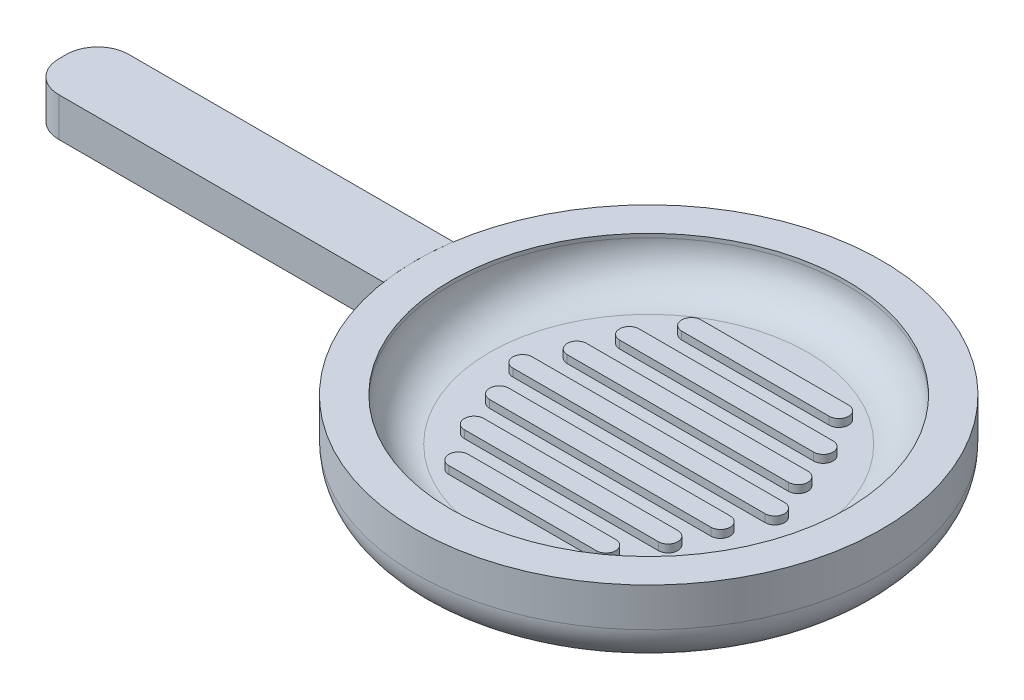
ISO-10303-21;
HEADER;
FILE_DESCRIPTION(('STEP AP214'),'2;1');
FILE_NAME('part.step','',(''),(''),'','','');
FILE_SCHEMA(('AUTOMOTIVE_DESIGN { 1 0 10303 214 1 1 1 1 }'));
ENDSEC;
DATA;
#1=APPLICATION_CONTEXT('core data for automotive mechanical design processes');
#2=APPLICATION_PROTOCOL_DEFINITION('international standard','automotive_design',2000,#1);
#3=PRODUCT_CONTEXT('',#1,'mechanical');
#4=PRODUCT('Part','Part','',(#3));
#5=PRODUCT_RELATED_PRODUCT_CATEGORY('part','',(#4));
#6=PRODUCT_DEFINITION_FORMATION('','',#4);
#7=PRODUCT_DEFINITION_CONTEXT('part definition',#1,'design');
#8=PRODUCT_DEFINITION('design','',#6,#7);
#9=PRODUCT_DEFINITION_SHAPE('','',#8);
#10=(LENGTH_UNIT() NAMED_UNIT(*) SI_UNIT(.MILLI.,.METRE.));
#11=(NAMED_UNIT(*) PLANE_ANGLE_UNIT() SI_UNIT($,.RADIAN.));
#12=(NAMED_UNIT(*) SI_UNIT($,.STERADIAN.) SOLID_ANGLE_UNIT());
#13=UNCERTAINTY_MEASURE_WITH_UNIT(LENGTH_MEASURE(1.E-05),#10,'distance_accuracy_value','');
#14=(GEOMETRIC_REPRESENTATION_CONTEXT(3) GLOBAL_UNCERTAINTY_ASSIGNED_CONTEXT((#13)) GLOBAL_UNIT_ASSIGNED_CONTEXT((#10,
#11,#12)) REPRESENTATION_CONTEXT('',''));
#15=CARTESIAN_POINT('',(0.,0.,0.));
#16=DIRECTION('',(0.,0.,1.));
#17=DIRECTION('',(1.,0.,0.));
#18=AXIS2_PLACEMENT_3D('',#15,#16,#17);
#19=CARTESIAN_POINT('',(-143.,10.,1.));
#20=DIRECTION('',(0.,1.,0.));
#21=DIRECTION('',(0.,0.,1.));
#22=AXIS2_PLACEMENT_3D('',#19,#20,#21);
#23=CYLINDRICAL_SURFACE('',#22,8.);
#24=CARTESIAN_POINT('',(-143.,20.,1.));
#25=DIRECTION('',(0.,1.,0.));
#26=DIRECTION('',(0.,0.,-1.));
#27=AXIS2_PLACEMENT_3D('',#24,#25,#26);
#28=CIRCLE('',#27,8.);
#29=CARTESIAN_POINT('',(-151.,20.,0.999999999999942));
#30=VERTEX_POINT('',#29);
#31=CARTESIAN_POINT('',(-143.,20.,9.));
#32=VERTEX_POINT('',#31);
#33=EDGE_CURVE('E135',#30,#32,#28,.T.);
#34=ORIENTED_EDGE('',*,*,#33,.F.);
#35=DIRECTION('',(0.,1.,0.));
#36=VECTOR('',#35,1.);
#37=CARTESIAN_POINT('',(-151.,10.,0.999999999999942));
#38=LINE('',#37,#36);
#39=CARTESIAN_POINT('',(-151.,10.,0.999999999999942));
#40=VERTEX_POINT('',#39);
#41=EDGE_CURVE('E12',#40,#30,#38,.T.);
#42=ORIENTED_EDGE('',*,*,#41,.F.);
#43=CARTESIAN_POINT('',(-143.,10.,1.));
#44=DIRECTION('',(0.,1.,0.));
#45=DIRECTION('',(0.,0.,-1.));
#46=AXIS2_PLACEMENT_3D('',#43,#44,#45);
#47=CIRCLE('',#46,8.);
#48=CARTESIAN_POINT('',(-143.,10.,9.));
#49=VERTEX_POINT('',#48);
#50=EDGE_CURVE('E149',#40,#49,#47,.T.);
#51=ORIENTED_EDGE('',*,*,#50,.T.);
#52=DIRECTION('',(0.,1.,0.));
#53=VECTOR('',#52,1.);
#54=CARTESIAN_POINT('',(-143.,10.,9.));
#55=LINE('',#54,#53);
#56=EDGE_CURVE('E53',#49,#32,#55,.T.);
#57=ORIENTED_EDGE('',*,*,#56,.T.);
#58=EDGE_LOOP('',(#34,#42,#51,#57));
#59=FACE_BOUND('',#58,.T.);
#60=ADVANCED_FACE('F50',(#59),#23,.T.);
#61=CARTESIAN_POINT('',(-151.,10.,-0.999999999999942));
#62=DIRECTION('',(-1.,0.,0.));
#63=DIRECTION('',(0.,0.,1.));
#64=AXIS2_PLACEMENT_3D('',#61,#62,#63);
#65=PLANE('',#64);
#66=DIRECTION('',(0.,0.,1.));
#67=VECTOR('',#66,1.);
#68=CARTESIAN_POINT('',(-151.,20.,-0.999999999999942));
#69=LINE('',#68,#67);
#70=CARTESIAN_POINT('',(-151.,20.,-0.999999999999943));
#71=VERTEX_POINT('',#70);
#72=EDGE_CURVE('E147',#71,#30,#69,.T.);
#73=ORIENTED_EDGE('',*,*,#72,.F.);
#74=DIRECTION('',(0.,1.,0.));
#75=VECTOR('',#74,1.);
#76=CARTESIAN_POINT('',(-151.,10.,-0.999999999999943));
#77=LINE('',#76,#75);
#78=CARTESIAN_POINT('',(-151.,10.,-0.999999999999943));
#79=VERTEX_POINT('',#78);
#80=EDGE_CURVE('E59',#79,#71,#77,.T.);
#81=ORIENTED_EDGE('',*,*,#80,.F.);
#82=DIRECTION('',(0.,0.,1.));
#83=VECTOR('',#82,1.);
#84=CARTESIAN_POINT('',(-151.,10.,-0.999999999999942));
#85=LINE('',#84,#83);
#86=EDGE_CURVE('E125',#79,#40,#85,.T.);
#87=ORIENTED_EDGE('',*,*,#86,.T.);
#88=ORIENTED_EDGE('',*,*,#41,.T.);
#89=EDGE_LOOP('',(#73,#81,#87,#88));
#90=FACE_BOUND('',#89,.T.);
#91=ADVANCED_FACE('F157',(#90),#65,.T.);
#92=CARTESIAN_POINT('',(-143.,10.,-1.));
#93=DIRECTION('',(0.,1.,0.));
#94=DIRECTION('',(0.,0.,1.));
#95=AXIS2_PLACEMENT_3D('',#92,#93,#94);
#96=CYLINDRICAL_SURFACE('',#95,8.);
#97=CARTESIAN_POINT('',(-143.,20.,-1.));
#98=DIRECTION('',(0.,1.,0.));
#99=DIRECTION('',(0.,0.,-1.));
#100=AXIS2_PLACEMENT_3D('',#97,#98,#99);
#101=CIRCLE('',#100,8.);
#102=CARTESIAN_POINT('',(-143.,20.,-9.));
#103=VERTEX_POINT('',#102);
#104=EDGE_CURVE('E112',#103,#71,#101,.T.);
#105=ORIENTED_EDGE('',*,*,#104,.F.);
#106=DIRECTION('',(0.,1.,0.));
#107=VECTOR('',#106,1.);
#108=CARTESIAN_POINT('',(-143.,10.,-9.));
#109=LINE('',#108,#107);
#110=CARTESIAN_POINT('',(-143.,10.,-9.));
#111=VERTEX_POINT('',#110);
#112=EDGE_CURVE('E107',#111,#103,#109,.T.);
#113=ORIENTED_EDGE('',*,*,#112,.F.);
#114=CARTESIAN_POINT('',(-143.,10.,-1.));
#115=DIRECTION('',(0.,1.,0.));
#116=DIRECTION('',(0.,0.,-1.));
#117=AXIS2_PLACEMENT_3D('',#114,#115,#116);
#118=CIRCLE('',#117,8.);
#119=EDGE_CURVE('E110',#111,#79,#118,.T.);
#120=ORIENTED_EDGE('',*,*,#119,.T.);
#121=ORIENTED_EDGE('',*,*,#80,.T.);
#122=EDGE_LOOP('',(#105,#113,#120,#121));
#123=FACE_BOUND('',#122,.T.);
#124=ADVANCED_FACE('F109',(#123),#96,.T.);
#125=CARTESIAN_POINT('',(-143.,10.,-9.));
#126=DIRECTION('',(0.,0.,-1.));
#127=DIRECTION('',(-1.,0.,0.));
#128=AXIS2_PLACEMENT_3D('',#125,#126,#127);
#129=PLANE('',#128);
#130=DIRECTION('',(-1.,0.,0.));
#131=VECTOR('',#130,1.);
#132=CARTESIAN_POINT('',(-143.,20.,-9.));
#133=LINE('',#132,#131);
#134=CARTESIAN_POINT('',(-59.3211597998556,20.,-9.00000000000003));
#135=VERTEX_POINT('',#134);
#136=EDGE_CURVE('E144',#135,#103,#133,.T.);
#137=ORIENTED_EDGE('',*,*,#136,.F.);
#138=DIRECTION('',(0.,1.,0.));
#139=VECTOR('',#138,1.);
#140=CARTESIAN_POINT('',(-59.3211597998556,10.,-9.00000000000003));
#141=LINE('',#140,#139);
#142=CARTESIAN_POINT('',(-59.3211597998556,10.,-9.00000000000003));
#143=VERTEX_POINT('',#142);
#144=EDGE_CURVE('E117',#143,#135,#141,.T.);
#145=ORIENTED_EDGE('',*,*,#144,.F.);
#146=DIRECTION('',(-1.,0.,0.));
#147=VECTOR('',#146,1.);
#148=CARTESIAN_POINT('',(-143.,10.,-9.));
#149=LINE('',#148,#147);
#150=EDGE_CURVE('E123',#143,#111,#149,.T.);
#151=ORIENTED_EDGE('',*,*,#150,.T.);
#152=ORIENTED_EDGE('',*,*,#112,.T.);
#153=EDGE_LOOP('',(#137,#145,#151,#152));
#154=FACE_BOUND('',#153,.T.);
#155=ADVANCED_FACE('F127',(#154),#129,.T.);
#156=CARTESIAN_POINT('',(0.,10.,0.));
#157=DIRECTION('',(0.,1.,0.));
#158=DIRECTION('',(0.,0.,1.));
#159=AXIS2_PLACEMENT_3D('',#156,#157,#158);
#160=CYLINDRICAL_SURFACE('',#159,60.);
#161=CARTESIAN_POINT('',(0.,20.,0.));
#162=DIRECTION('',(0.,-1.,0.));
#163=DIRECTION('',(0.,0.,1.));
#164=AXIS2_PLACEMENT_3D('',#161,#162,#163);
#165=CIRCLE('',#164,60.);
#166=CARTESIAN_POINT('',(-59.3211597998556,20.,9.));
#167=VERTEX_POINT('',#166);
#168=EDGE_CURVE('E141',#167,#135,#165,.T.);
#169=ORIENTED_EDGE('',*,*,#168,.F.);
#170=DIRECTION('',(0.,1.,0.));
#171=VECTOR('',#170,1.);
#172=CARTESIAN_POINT('',(-59.3211597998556,10.,9.));
#173=LINE('',#172,#171);
#174=CARTESIAN_POINT('',(-59.3211597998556,10.,9.));
#175=VERTEX_POINT('',#174);
#176=EDGE_CURVE('E152',#175,#167,#173,.T.);
#177=ORIENTED_EDGE('',*,*,#176,.F.);
#178=CARTESIAN_POINT('',(0.,10.,0.));
#179=DIRECTION('',(0.,-1.,0.));
#180=DIRECTION('',(0.,0.,1.));
#181=AXIS2_PLACEMENT_3D('',#178,#179,#180);
#182=CIRCLE('',#181,60.);
#183=EDGE_CURVE('E128',#175,#143,#182,.T.);
#184=ORIENTED_EDGE('',*,*,#183,.T.);
#185=ORIENTED_EDGE('',*,*,#144,.T.);
#186=EDGE_LOOP('',(#169,#177,#184,#185));
#187=FACE_BOUND('',#186,.T.);
#188=ADVANCED_FACE('F170',(#187),#160,.F.);
#189=CARTESIAN_POINT('',(-143.,10.,9.));
#190=DIRECTION('',(0.,0.,1.));
#191=DIRECTION('',(1.,0.,0.));
#192=AXIS2_PLACEMENT_3D('',#189,#190,#191);
#193=PLANE('',#192);
#194=DIRECTION('',(1.,0.,0.));
#195=VECTOR('',#194,1.);
#196=CARTESIAN_POINT('',(-143.,20.,9.));
#197=LINE('',#196,#195);
#198=EDGE_CURVE('E138',#32,#167,#197,.T.);
#199=ORIENTED_EDGE('',*,*,#198,.F.);
#200=ORIENTED_EDGE('',*,*,#56,.F.);
#201=DIRECTION('',(1.,0.,0.));
#202=VECTOR('',#201,1.);
#203=CARTESIAN_POINT('',(-143.,10.,9.));
#204=LINE('',#203,#202);
#205=EDGE_CURVE('E130',#49,#175,#204,.T.);
#206=ORIENTED_EDGE('',*,*,#205,.T.);
#207=ORIENTED_EDGE('',*,*,#176,.T.);
#208=EDGE_LOOP('',(#199,#200,#206,#207));
#209=FACE_BOUND('',#208,.T.);
#210=ADVANCED_FACE('F154',(#209),#193,.T.);
#211=CARTESIAN_POINT('',(-143.,10.,1.));
#212=DIRECTION('',(0.,-1.,0.));
#213=DIRECTION('',(0.,0.,-1.));
#214=AXIS2_PLACEMENT_3D('',#211,#212,#213);
#215=PLANE('',#214);
#216=ORIENTED_EDGE('',*,*,#50,.F.);
#217=ORIENTED_EDGE('',*,*,#86,.F.);
#218=ORIENTED_EDGE('',*,*,#119,.F.);
#219=ORIENTED_EDGE('',*,*,#150,.F.);
#220=ORIENTED_EDGE('',*,*,#183,.F.);
#221=ORIENTED_EDGE('',*,*,#205,.F.);
#222=EDGE_LOOP('',(#216,#217,#218,#219,#220,#221));
#223=FACE_BOUND('',#222,.T.);
#224=ADVANCED_FACE('F121',(#223),#215,.T.);
#225=CARTESIAN_POINT('',(-143.,20.,1.));
#226=DIRECTION('',(0.,-1.,0.));
#227=DIRECTION('',(0.,0.,-1.));
#228=AXIS2_PLACEMENT_3D('',#225,#226,#227);
#229=PLANE('',#228);
#230=ORIENTED_EDGE('',*,*,#33,.T.);
#231=ORIENTED_EDGE('',*,*,#198,.T.);
#232=ORIENTED_EDGE('',*,*,#168,.T.);
#233=ORIENTED_EDGE('',*,*,#136,.T.);
#234=ORIENTED_EDGE('',*,*,#104,.T.);
#235=ORIENTED_EDGE('',*,*,#72,.T.);
#236=EDGE_LOOP('',(#230,#231,#232,#233,#234,#235));
#237=FACE_BOUND('',#236,.T.);
#238=ADVANCED_FACE('F156',(#237),#229,.F.);
#239=CLOSED_SHELL('',(#60,#91,#124,#155,#188,#210,#224,#238));
#240=MANIFOLD_SOLID_BREP('B2',#239);
#241=CARTESIAN_POINT('',(0.,9.,0.));
#242=DIRECTION('',(0.,1.,0.));
#243=DIRECTION('',(0.,0.,1.));
#244=AXIS2_PLACEMENT_3D('',#241,#242,#243);
#245=PLANE('',#244);
#246=CARTESIAN_POINT('',(0.,9.,0.));
#247=DIRECTION('',(0.,1.,0.));
#248=DIRECTION('',(0.,0.,1.));
#249=AXIS2_PLACEMENT_3D('',#246,#247,#248);
#250=CIRCLE('',#249,41.);
#251=CARTESIAN_POINT('',(0.,9.,41.));
#252=VERTEX_POINT('',#251);
#253=EDGE_CURVE('E618',#252,#252,#250,.T.);
#254=ORIENTED_EDGE('',*,*,#253,.T.);
#255=EDGE_LOOP('',(#254));
#256=FACE_BOUND('',#255,.T.);
#257=DIRECTION('',(1.,0.,0.));
#258=VECTOR('',#257,1.);
#259=CARTESIAN_POINT('',(-28.5,9.,12.5));
#260=LINE('',#259,#258);
#261=CARTESIAN_POINT('',(-28.5,9.,12.5));
#262=VERTEX_POINT('',#261);
#263=CARTESIAN_POINT('',(28.5,9.,12.5));
#264=VERTEX_POINT('',#263);
#265=EDGE_CURVE('E597',#262,#264,#260,.T.);
#266=ORIENTED_EDGE('',*,*,#265,.F.);
#267=CARTESIAN_POINT('',(-28.5,9.,10.));
#268=DIRECTION('',(0.,1.,0.));
#269=DIRECTION('',(0.,0.,-1.));
#270=AXIS2_PLACEMENT_3D('',#267,#268,#269);
#271=CIRCLE('',#270,2.5);
#272=CARTESIAN_POINT('',(-28.5,9.,7.5));
#273=VERTEX_POINT('',#272);
#274=EDGE_CURVE('E583',#273,#262,#271,.T.);
#275=ORIENTED_EDGE('',*,*,#274,.F.);
#276=DIRECTION('',(-1.,0.,0.));
#277=VECTOR('',#276,1.);
#278=CARTESIAN_POINT('',(-28.5,9.,7.5));
#279=LINE('',#278,#277);
#280=CARTESIAN_POINT('',(28.5,9.,7.50000000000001));
#281=VERTEX_POINT('',#280);
#282=EDGE_CURVE('E588',#281,#273,#279,.T.);
#283=ORIENTED_EDGE('',*,*,#282,.F.);
#284=CARTESIAN_POINT('',(28.5,9.,10.));
#285=DIRECTION('',(0.,1.,0.));
#286=DIRECTION('',(0.,0.,-1.));
#287=AXIS2_PLACEMENT_3D('',#284,#285,#286);
#288=CIRCLE('',#287,2.5);
#289=EDGE_CURVE('E599',#264,#281,#288,.T.);
#290=ORIENTED_EDGE('',*,*,#289,.F.);
#291=EDGE_LOOP('',(#266,#275,#283,#290));
#292=FACE_BOUND('',#291,.T.);
#293=DIRECTION('',(1.,0.,0.));
#294=VECTOR('',#293,1.);
#295=CARTESIAN_POINT('',(-25.0000000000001,9.,-17.5));
#296=LINE('',#295,#294);
#297=CARTESIAN_POINT('',(-25.0000000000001,9.,-17.5));
#298=VERTEX_POINT('',#297);
#299=CARTESIAN_POINT('',(24.9999999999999,9.,-17.5));
#300=VERTEX_POINT('',#299);
#301=EDGE_CURVE('E568',#298,#300,#296,.T.);
#302=ORIENTED_EDGE('',*,*,#301,.F.);
#303=CARTESIAN_POINT('',(-25.0000000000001,9.,-20.));
#304=DIRECTION('',(0.,1.,0.));
#305=DIRECTION('',(0.,0.,1.));
#306=AXIS2_PLACEMENT_3D('',#303,#304,#305);
#307=CIRCLE('',#306,2.5);
#308=CARTESIAN_POINT('',(-25.0000000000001,9.,-22.5));
#309=VERTEX_POINT('',#308);
#310=EDGE_CURVE('E554',#309,#298,#307,.T.);
#311=ORIENTED_EDGE('',*,*,#310,.F.);
#312=DIRECTION('',(-1.,0.,0.));
#313=VECTOR('',#312,1.);
#314=CARTESIAN_POINT('',(-25.0000000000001,9.,-22.5));
#315=LINE('',#314,#313);
#316=CARTESIAN_POINT('',(24.9999999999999,9.,-22.5));
#317=VERTEX_POINT('',#316);
#318=EDGE_CURVE('E559',#317,#309,#315,.T.);
#319=ORIENTED_EDGE('',*,*,#318,.F.);
#320=CARTESIAN_POINT('',(24.9999999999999,9.,-20.));
#321=DIRECTION('',(0.,1.,0.));
#322=DIRECTION('',(0.,0.,1.));
#323=AXIS2_PLACEMENT_3D('',#320,#321,#322);
#324=CIRCLE('',#323,2.5);
#325=EDGE_CURVE('E570',#300,#317,#324,.T.);
#326=ORIENTED_EDGE('',*,*,#325,.F.);
#327=EDGE_LOOP('',(#302,#311,#319,#326));
#328=FACE_BOUND('',#327,.T.);
#329=DIRECTION('',(1.,0.,0.));
#330=VECTOR('',#329,1.);
#331=CARTESIAN_POINT('',(-25.0000000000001,9.,22.5));
#332=LINE('',#331,#330);
#333=CARTESIAN_POINT('',(-25.0000000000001,9.,22.5));
#334=VERTEX_POINT('',#333);
#335=CARTESIAN_POINT('',(24.9999999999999,9.,22.5));
#336=VERTEX_POINT('',#335);
#337=EDGE_CURVE('E539',#334,#336,#332,.T.);
#338=ORIENTED_EDGE('',*,*,#337,.F.);
#339=CARTESIAN_POINT('',(-25.0000000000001,9.,20.));
#340=DIRECTION('',(0.,1.,0.));
#341=DIRECTION('',(0.,0.,-1.));
#342=AXIS2_PLACEMENT_3D('',#339,#340,#341);
#343=CIRCLE('',#342,2.5);
#344=CARTESIAN_POINT('',(-25.0000000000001,9.,17.5));
#345=VERTEX_POINT('',#344);
#346=EDGE_CURVE('E525',#345,#334,#343,.T.);
#347=ORIENTED_EDGE('',*,*,#346,.F.);
#348=DIRECTION('',(-1.,0.,0.));
#349=VECTOR('',#348,1.);
#350=CARTESIAN_POINT('',(-25.0000000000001,9.,17.5));
#351=LINE('',#350,#349);
#352=CARTESIAN_POINT('',(24.9999999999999,9.,17.5));
#353=VERTEX_POINT('',#352);
#354=EDGE_CURVE('E530',#353,#345,#351,.T.);
#355=ORIENTED_EDGE('',*,*,#354,.F.);
#356=CARTESIAN_POINT('',(24.9999999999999,9.,20.));
#357=DIRECTION('',(0.,1.,0.));
#358=DIRECTION('',(0.,0.,-1.));
#359=AXIS2_PLACEMENT_3D('',#356,#357,#358);
#360=CIRCLE('',#359,2.5);
#361=EDGE_CURVE('E541',#336,#353,#360,.T.);
#362=ORIENTED_EDGE('',*,*,#361,.F.);
#363=EDGE_LOOP('',(#338,#347,#355,#362));
#364=FACE_BOUND('',#363,.T.);
#365=DIRECTION('',(1.,0.,0.));
#366=VECTOR('',#365,1.);
#367=CARTESIAN_POINT('',(-28.5,9.,-7.5));
#368=LINE('',#367,#366);
#369=CARTESIAN_POINT('',(-28.5,9.,-7.5));
#370=VERTEX_POINT('',#369);
#371=CARTESIAN_POINT('',(28.5,9.,-7.50000000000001));
#372=VERTEX_POINT('',#371);
#373=EDGE_CURVE('E510',#370,#372,#368,.T.);
#374=ORIENTED_EDGE('',*,*,#373,.F.);
#375=CARTESIAN_POINT('',(-28.5,9.,-10.));
#376=DIRECTION('',(0.,1.,0.));
#377=DIRECTION('',(0.,0.,1.));
#378=AXIS2_PLACEMENT_3D('',#375,#376,#377);
#379=CIRCLE('',#378,2.5);
#380=CARTESIAN_POINT('',(-28.5,9.,-12.5));
#381=VERTEX_POINT('',#380);
#382=EDGE_CURVE('E496',#381,#370,#379,.T.);
#383=ORIENTED_EDGE('',*,*,#382,.F.);
#384=DIRECTION('',(-1.,0.,0.));
#385=VECTOR('',#384,1.);
#386=CARTESIAN_POINT('',(-28.5,9.,-12.5));
#387=LINE('',#386,#385);
#388=CARTESIAN_POINT('',(28.5,9.,-12.5));
#389=VERTEX_POINT('',#388);
#390=EDGE_CURVE('E501',#389,#381,#387,.T.);
#391=ORIENTED_EDGE('',*,*,#390,.F.);
#392=CARTESIAN_POINT('',(28.5,9.,-10.));
#393=DIRECTION('',(0.,1.,0.));
#394=DIRECTION('',(0.,0.,1.));
#395=AXIS2_PLACEMENT_3D('',#392,#393,#394);
#396=CIRCLE('',#395,2.5);
#397=EDGE_CURVE('E512',#372,#389,#396,.T.);
#398=ORIENTED_EDGE('',*,*,#397,.F.);
#399=EDGE_LOOP('',(#374,#383,#391,#398));
#400=FACE_BOUND('',#399,.T.);
#401=DIRECTION('',(1.,0.,0.));
#402=VECTOR('',#401,1.);
#403=CARTESIAN_POINT('',(-18.9999999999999,9.,-27.5));
#404=LINE('',#403,#402);
#405=CARTESIAN_POINT('',(-18.9999999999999,9.,-27.5));
#406=VERTEX_POINT('',#405);
#407=CARTESIAN_POINT('',(19.,9.,-27.5));
#408=VERTEX_POINT('',#407);
#409=EDGE_CURVE('E481',#406,#408,#404,.T.);
#410=ORIENTED_EDGE('',*,*,#409,.F.);
#411=CARTESIAN_POINT('',(-19.,9.,-30.));
#412=DIRECTION('',(0.,1.,0.));
#413=DIRECTION('',(0.,0.,1.));
#414=AXIS2_PLACEMENT_3D('',#411,#412,#413);
#415=CIRCLE('',#414,2.50000000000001);
#416=CARTESIAN_POINT('',(-19.,9.,-32.5));
#417=VERTEX_POINT('',#416);
#418=EDGE_CURVE('E467',#417,#406,#415,.T.);
#419=ORIENTED_EDGE('',*,*,#418,.F.);
#420=DIRECTION('',(-1.,0.,0.));
#421=VECTOR('',#420,1.);
#422=CARTESIAN_POINT('',(-19.,9.,-32.5));
#423=LINE('',#422,#421);
#424=CARTESIAN_POINT('',(19.,9.,-32.5));
#425=VERTEX_POINT('',#424);
#426=EDGE_CURVE('E472',#425,#417,#423,.T.);
#427=ORIENTED_EDGE('',*,*,#426,.F.);
#428=CARTESIAN_POINT('',(19.,9.,-30.));
#429=DIRECTION('',(0.,1.,0.));
#430=DIRECTION('',(0.,0.,1.));
#431=AXIS2_PLACEMENT_3D('',#428,#429,#430);
#432=CIRCLE('',#431,2.50000000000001);
#433=EDGE_CURVE('E483',#408,#425,#432,.T.);
#434=ORIENTED_EDGE('',*,*,#433,.F.);
#435=EDGE_LOOP('',(#410,#419,#427,#434));
#436=FACE_BOUND('',#435,.T.);
#437=DIRECTION('',(1.,0.,0.));
#438=VECTOR('',#437,1.);
#439=CARTESIAN_POINT('',(-32.5000000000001,9.,2.5));
#440=LINE('',#439,#438);
#441=CARTESIAN_POINT('',(-32.5000000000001,9.,2.5));
#442=VERTEX_POINT('',#441);
#443=CARTESIAN_POINT('',(32.4999999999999,9.,2.49999999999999));
#444=VERTEX_POINT('',#443);
#445=EDGE_CURVE('E439',#442,#444,#440,.T.);
#446=ORIENTED_EDGE('',*,*,#445,.F.);
#447=CARTESIAN_POINT('',(-32.5000000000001,9.,0.));
#448=DIRECTION('',(0.,1.,0.));
#449=DIRECTION('',(0.,0.,1.));
#450=AXIS2_PLACEMENT_3D('',#447,#448,#449);
#451=CIRCLE('',#450,2.5);
#452=CARTESIAN_POINT('',(-32.5000000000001,9.,-2.5));
#453=VERTEX_POINT('',#452);
#454=EDGE_CURVE('E436',#453,#442,#451,.T.);
#455=ORIENTED_EDGE('',*,*,#454,.F.);
#456=DIRECTION('',(-1.,0.,0.));
#457=VECTOR('',#456,1.);
#458=CARTESIAN_POINT('',(-32.5000000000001,9.,-2.5));
#459=LINE('',#458,#457);
#460=CARTESIAN_POINT('',(32.4999999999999,9.,-2.5));
#461=VERTEX_POINT('',#460);
#462=EDGE_CURVE('E448',#461,#453,#459,.T.);
#463=ORIENTED_EDGE('',*,*,#462,.F.);
#464=CARTESIAN_POINT('',(32.4999999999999,9.,0.));
#465=DIRECTION('',(0.,1.,0.));
#466=DIRECTION('',(0.,0.,1.));
#467=AXIS2_PLACEMENT_3D('',#464,#465,#466);
#468=CIRCLE('',#467,2.5);
#469=EDGE_CURVE('E456',#444,#461,#468,.T.);
#470=ORIENTED_EDGE('',*,*,#469,.F.);
#471=EDGE_LOOP('',(#446,#455,#463,#470));
#472=FACE_BOUND('',#471,.T.);
#473=DIRECTION('',(1.,0.,0.));
#474=VECTOR('',#473,1.);
#475=CARTESIAN_POINT('',(-18.9999999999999,9.,32.5));
#476=LINE('',#475,#474);
#477=CARTESIAN_POINT('',(-18.9999999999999,9.,32.5));
#478=VERTEX_POINT('',#477);
#479=CARTESIAN_POINT('',(19.,9.,32.5));
#480=VERTEX_POINT('',#479);
#481=EDGE_CURVE('E1033',#478,#480,#476,.T.);
#482=ORIENTED_EDGE('',*,*,#481,.F.);
#483=CARTESIAN_POINT('',(-18.9999999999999,9.,30.));
#484=DIRECTION('',(0.,1.,0.));
#485=DIRECTION('',(0.,0.,-1.));
#486=AXIS2_PLACEMENT_3D('',#483,#484,#485);
#487=CIRCLE('',#486,2.50000000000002);
#488=CARTESIAN_POINT('',(-18.9999999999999,9.,27.5));
#489=VERTEX_POINT('',#488);
#490=EDGE_CURVE('E434',#489,#478,#487,.T.);
#491=ORIENTED_EDGE('',*,*,#490,.F.);
#492=DIRECTION('',(-1.,0.,0.));
#493=VECTOR('',#492,1.);
#494=CARTESIAN_POINT('',(-18.9999999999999,9.,27.5));
#495=LINE('',#494,#493);
#496=CARTESIAN_POINT('',(19.,9.,27.5));
#497=VERTEX_POINT('',#496);
#498=EDGE_CURVE('E430',#497,#489,#495,.T.);
#499=ORIENTED_EDGE('',*,*,#498,.F.);
#500=CARTESIAN_POINT('',(19.,9.,30.));
#501=DIRECTION('',(0.,1.,0.));
#502=DIRECTION('',(0.,0.,-1.));
#503=AXIS2_PLACEMENT_3D('',#500,#501,#502);
#504=CIRCLE('',#503,2.50000000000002);
#505=EDGE_CURVE('E1030',#480,#497,#504,.T.);
#506=ORIENTED_EDGE('',*,*,#505,.F.);
#507=EDGE_LOOP('',(#482,#491,#499,#506));
#508=FACE_BOUND('',#507,.T.);
#509=ADVANCED_FACE('F225',(#256,#292,#328,#364,#400,#436,#472,#508),#245,.T.);
#510=CARTESIAN_POINT('',(0.,20.,0.));
#511=DIRECTION('',(0.,-1.,0.));
#512=DIRECTION('',(0.,0.,-1.));
#513=AXIS2_PLACEMENT_3D('',#510,#511,#512);
#514=CYLINDRICAL_SURFACE('',#513,60.);
#515=CARTESIAN_POINT('',(0.,10.,0.));
#516=DIRECTION('',(0.,1.,0.));
#517=DIRECTION('',(0.,0.,1.));
#518=AXIS2_PLACEMENT_3D('',#515,#516,#517);
#519=CIRCLE('',#518,60.);
#520=CARTESIAN_POINT('',(0.,10.,60.));
#521=VERTEX_POINT('',#520);
#522=EDGE_CURVE('E233',#521,#521,#519,.T.);
#523=ORIENTED_EDGE('',*,*,#522,.T.);
#524=EDGE_LOOP('',(#523));
#525=FACE_BOUND('',#524,.T.);
#526=CARTESIAN_POINT('',(0.,20.,0.));
#527=DIRECTION('',(0.,1.,0.));
#528=DIRECTION('',(0.,0.,1.));
#529=AXIS2_PLACEMENT_3D('',#526,#527,#528);
#530=CIRCLE('',#529,60.);
#531=CARTESIAN_POINT('',(0.,20.,60.));
#532=VERTEX_POINT('',#531);
#533=EDGE_CURVE('E615',#532,#532,#530,.T.);
#534=ORIENTED_EDGE('',*,*,#533,.F.);
#535=EDGE_LOOP('',(#534));
#536=FACE_BOUND('',#535,.T.);
#537=ADVANCED_FACE('F626',(#525,#536),#514,.T.);
#538=CARTESIAN_POINT('',(0.,20.,0.));
#539=DIRECTION('',(0.,1.,0.));
#540=DIRECTION('',(0.,0.,1.));
#541=AXIS2_PLACEMENT_3D('',#538,#539,#540);
#542=PLANE('',#541);
#543=CARTESIAN_POINT('',(0.,20.,0.));
#544=DIRECTION('',(0.,1.,0.));
#545=DIRECTION('',(0.,0.,1.));
#546=AXIS2_PLACEMENT_3D('',#543,#544,#545);
#547=CIRCLE('',#546,51.);
#548=CARTESIAN_POINT('',(0.,20.,51.));
#549=VERTEX_POINT('',#548);
#550=EDGE_CURVE('E612',#549,#549,#547,.T.);
#551=ORIENTED_EDGE('',*,*,#550,.F.);
#552=EDGE_LOOP('',(#551));
#553=FACE_BOUND('',#552,.T.);
#554=ORIENTED_EDGE('',*,*,#533,.T.);
#555=EDGE_LOOP('',(#554));
#556=FACE_BOUND('',#555,.T.);
#557=ADVANCED_FACE('F649',(#553,#556),#542,.T.);
#558=CARTESIAN_POINT('',(0.,0.,0.));
#559=DIRECTION('',(0.,1.,0.));
#560=DIRECTION('',(0.,0.,1.));
#561=AXIS2_PLACEMENT_3D('',#558,#559,#560);
#562=PLANE('',#561);
#563=CARTESIAN_POINT('',(0.,0.,0.));
#564=DIRECTION('',(0.,1.,0.));
#565=DIRECTION('',(0.,0.,1.));
#566=AXIS2_PLACEMENT_3D('',#563,#564,#565);
#567=CIRCLE('',#566,50.);
#568=CARTESIAN_POINT('',(0.,0.,50.));
#569=VERTEX_POINT('',#568);
#570=EDGE_CURVE('E48',#569,#569,#567,.F.);
#571=ORIENTED_EDGE('',*,*,#570,.T.);
#572=EDGE_LOOP('',(#571));
#573=FACE_BOUND('',#572,.T.);
#574=ADVANCED_FACE('F656',(#573),#562,.F.);
#575=CARTESIAN_POINT('',(0.,20.,0.));
#576=DIRECTION('',(0.,-1.,0.));
#577=DIRECTION('',(0.,0.,-1.));
#578=AXIS2_PLACEMENT_3D('',#575,#576,#577);
#579=CYLINDRICAL_SURFACE('',#578,51.);
#580=CARTESIAN_POINT('',(0.,19.,0.));
#581=DIRECTION('',(0.,1.,0.));
#582=DIRECTION('',(0.,0.,1.));
#583=AXIS2_PLACEMENT_3D('',#580,#581,#582);
#584=CIRCLE('',#583,51.);
#585=CARTESIAN_POINT('',(0.,19.,51.));
#586=VERTEX_POINT('',#585);
#587=EDGE_CURVE('E621',#586,#586,#584,.F.);
#588=ORIENTED_EDGE('',*,*,#587,.T.);
#589=EDGE_LOOP('',(#588));
#590=FACE_BOUND('',#589,.T.);
#591=ORIENTED_EDGE('',*,*,#550,.T.);
#592=EDGE_LOOP('',(#591));
#593=FACE_BOUND('',#592,.T.);
#594=ADVANCED_FACE('F640',(#590,#593),#579,.F.);
#595=CARTESIAN_POINT('',(0.,19.,0.));
#596=DIRECTION('',(0.,1.,0.));
#597=DIRECTION('',(0.,0.,1.));
#598=AXIS2_PLACEMENT_3D('',#595,#596,#597);
#599=TOROIDAL_SURFACE('',#598,41.,10.);
#600=ORIENTED_EDGE('',*,*,#587,.F.);
#601=EDGE_LOOP('',(#600));
#602=FACE_BOUND('',#601,.T.);
#603=ORIENTED_EDGE('',*,*,#253,.F.);
#604=EDGE_LOOP('',(#603));
#605=FACE_BOUND('',#604,.T.);
#606=ADVANCED_FACE('F631',(#602,#605),#599,.F.);
#607=CARTESIAN_POINT('',(0.,10.,0.));
#608=DIRECTION('',(0.,1.,0.));
#609=DIRECTION('',(0.,0.,1.));
#610=AXIS2_PLACEMENT_3D('',#607,#608,#609);
#611=TOROIDAL_SURFACE('',#610,50.,10.);
#612=ORIENTED_EDGE('',*,*,#570,.F.);
#613=EDGE_LOOP('',(#612));
#614=FACE_BOUND('',#613,.T.);
#615=ORIENTED_EDGE('',*,*,#522,.F.);
#616=EDGE_LOOP('',(#615));
#617=FACE_BOUND('',#616,.T.);
#618=ADVANCED_FACE('F227',(#614,#617),#611,.T.);
#619=CARTESIAN_POINT('',(-28.5,11.,10.));
#620=DIRECTION('',(0.,-1.,0.));
#621=DIRECTION('',(0.,0.,-1.));
#622=AXIS2_PLACEMENT_3D('',#619,#620,#621);
#623=CYLINDRICAL_SURFACE('',#622,2.5);
#624=ORIENTED_EDGE('',*,*,#274,.T.);
#625=DIRECTION('',(0.,-1.,0.));
#626=VECTOR('',#625,1.);
#627=CARTESIAN_POINT('',(-28.5,11.,12.5));
#628=LINE('',#627,#626);
#629=CARTESIAN_POINT('',(-28.5,11.,12.5));
#630=VERTEX_POINT('',#629);
#631=EDGE_CURVE('E610',#630,#262,#628,.T.);
#632=ORIENTED_EDGE('',*,*,#631,.F.);
#633=CARTESIAN_POINT('',(-28.5,11.,10.));
#634=DIRECTION('',(0.,1.,0.));
#635=DIRECTION('',(0.,0.,-1.));
#636=AXIS2_PLACEMENT_3D('',#633,#634,#635);
#637=CIRCLE('',#636,2.5);
#638=CARTESIAN_POINT('',(-28.5,11.,7.5));
#639=VERTEX_POINT('',#638);
#640=EDGE_CURVE('E584',#639,#630,#637,.T.);
#641=ORIENTED_EDGE('',*,*,#640,.F.);
#642=DIRECTION('',(0.,-1.,0.));
#643=VECTOR('',#642,1.);
#644=CARTESIAN_POINT('',(-28.5,11.,7.5));
#645=LINE('',#644,#643);
#646=EDGE_CURVE('E594',#639,#273,#645,.T.);
#647=ORIENTED_EDGE('',*,*,#646,.T.);
#648=EDGE_LOOP('',(#624,#632,#641,#647));
#649=FACE_BOUND('',#648,.T.);
#650=ADVANCED_FACE('F630',(#649),#623,.T.);
#651=CARTESIAN_POINT('',(-28.5,11.,12.5));
#652=DIRECTION('',(0.,0.,-1.));
#653=DIRECTION('',(-1.,0.,0.));
#654=AXIS2_PLACEMENT_3D('',#651,#652,#653);
#655=PLANE('',#654);
#656=ORIENTED_EDGE('',*,*,#265,.T.);
#657=DIRECTION('',(0.,-1.,0.));
#658=VECTOR('',#657,1.);
#659=CARTESIAN_POINT('',(28.5,11.,12.5));
#660=LINE('',#659,#658);
#661=CARTESIAN_POINT('',(28.5,11.,12.5));
#662=VERTEX_POINT('',#661);
#663=EDGE_CURVE('E607',#662,#264,#660,.T.);
#664=ORIENTED_EDGE('',*,*,#663,.F.);
#665=DIRECTION('',(1.,0.,0.));
#666=VECTOR('',#665,1.);
#667=CARTESIAN_POINT('',(-28.5,11.,12.5));
#668=LINE('',#667,#666);
#669=EDGE_CURVE('E587',#630,#662,#668,.T.);
#670=ORIENTED_EDGE('',*,*,#669,.F.);
#671=ORIENTED_EDGE('',*,*,#631,.T.);
#672=EDGE_LOOP('',(#656,#664,#670,#671));
#673=FACE_BOUND('',#672,.T.);
#674=ADVANCED_FACE('F637',(#673),#655,.F.);
#675=CARTESIAN_POINT('',(28.5,11.,10.));
#676=DIRECTION('',(0.,-1.,0.));
#677=DIRECTION('',(0.,0.,-1.));
#678=AXIS2_PLACEMENT_3D('',#675,#676,#677);
#679=CYLINDRICAL_SURFACE('',#678,2.5);
#680=ORIENTED_EDGE('',*,*,#289,.T.);
#681=DIRECTION('',(0.,-1.,0.));
#682=VECTOR('',#681,1.);
#683=CARTESIAN_POINT('',(28.5,11.,7.50000000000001));
#684=LINE('',#683,#682);
#685=CARTESIAN_POINT('',(28.5,11.,7.50000000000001));
#686=VERTEX_POINT('',#685);
#687=EDGE_CURVE('E605',#686,#281,#684,.T.);
#688=ORIENTED_EDGE('',*,*,#687,.F.);
#689=CARTESIAN_POINT('',(28.5,11.,10.));
#690=DIRECTION('',(0.,1.,0.));
#691=DIRECTION('',(0.,0.,-1.));
#692=AXIS2_PLACEMENT_3D('',#689,#690,#691);
#693=CIRCLE('',#692,2.5);
#694=EDGE_CURVE('E590',#662,#686,#693,.T.);
#695=ORIENTED_EDGE('',*,*,#694,.F.);
#696=ORIENTED_EDGE('',*,*,#663,.T.);
#697=EDGE_LOOP('',(#680,#688,#695,#696));
#698=FACE_BOUND('',#697,.T.);
#699=ADVANCED_FACE('F700',(#698),#679,.T.);
#700=CARTESIAN_POINT('',(-28.5,11.,7.5));
#701=DIRECTION('',(0.,0.,1.));
#702=DIRECTION('',(1.,0.,0.));
#703=AXIS2_PLACEMENT_3D('',#700,#701,#702);
#704=PLANE('',#703);
#705=ORIENTED_EDGE('',*,*,#282,.T.);
#706=ORIENTED_EDGE('',*,*,#646,.F.);
#707=DIRECTION('',(-1.,0.,0.));
#708=VECTOR('',#707,1.);
#709=CARTESIAN_POINT('',(-28.5,11.,7.5));
#710=LINE('',#709,#708);
#711=EDGE_CURVE('E592',#686,#639,#710,.T.);
#712=ORIENTED_EDGE('',*,*,#711,.F.);
#713=ORIENTED_EDGE('',*,*,#687,.T.);
#714=EDGE_LOOP('',(#705,#706,#712,#713));
#715=FACE_BOUND('',#714,.T.);
#716=ADVANCED_FACE('F710',(#715),#704,.F.);
#717=CARTESIAN_POINT('',(-28.5,11.,10.));
#718=DIRECTION('',(0.,-1.,0.));
#719=DIRECTION('',(0.,0.,-1.));
#720=AXIS2_PLACEMENT_3D('',#717,#718,#719);
#721=PLANE('',#720);
#722=ORIENTED_EDGE('',*,*,#640,.T.);
#723=ORIENTED_EDGE('',*,*,#669,.T.);
#724=ORIENTED_EDGE('',*,*,#694,.T.);
#725=ORIENTED_EDGE('',*,*,#711,.T.);
#726=EDGE_LOOP('',(#722,#723,#724,#725));
#727=FACE_BOUND('',#726,.T.);
#728=ADVANCED_FACE('F720',(#727),#721,.F.);
#729=CARTESIAN_POINT('',(-25.0000000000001,11.,-20.));
#730=DIRECTION('',(0.,-1.,0.));
#731=DIRECTION('',(0.,0.,-1.));
#732=AXIS2_PLACEMENT_3D('',#729,#730,#731);
#733=CYLINDRICAL_SURFACE('',#732,2.5);
#734=ORIENTED_EDGE('',*,*,#310,.T.);
#735=DIRECTION('',(0.,-1.,0.));
#736=VECTOR('',#735,1.);
#737=CARTESIAN_POINT('',(-25.0000000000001,11.,-17.5));
#738=LINE('',#737,#736);
#739=CARTESIAN_POINT('',(-25.0000000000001,11.,-17.5));
#740=VERTEX_POINT('',#739);
#741=EDGE_CURVE('E581',#740,#298,#738,.T.);
#742=ORIENTED_EDGE('',*,*,#741,.F.);
#743=CARTESIAN_POINT('',(-25.0000000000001,11.,-20.));
#744=DIRECTION('',(0.,1.,0.));
#745=DIRECTION('',(0.,0.,1.));
#746=AXIS2_PLACEMENT_3D('',#743,#744,#745);
#747=CIRCLE('',#746,2.5);
#748=CARTESIAN_POINT('',(-25.0000000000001,11.,-22.5));
#749=VERTEX_POINT('',#748);
#750=EDGE_CURVE('E555',#749,#740,#747,.T.);
#751=ORIENTED_EDGE('',*,*,#750,.F.);
#752=DIRECTION('',(0.,-1.,0.));
#753=VECTOR('',#752,1.);
#754=CARTESIAN_POINT('',(-25.0000000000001,11.,-22.5));
#755=LINE('',#754,#753);
#756=EDGE_CURVE('E565',#749,#309,#755,.T.);
#757=ORIENTED_EDGE('',*,*,#756,.T.);
#758=EDGE_LOOP('',(#734,#742,#751,#757));
#759=FACE_BOUND('',#758,.T.);
#760=ADVANCED_FACE('F730',(#759),#733,.T.);
#761=CARTESIAN_POINT('',(-25.0000000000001,11.,-17.5));
#762=DIRECTION('',(0.,0.,-1.));
#763=DIRECTION('',(-1.,0.,0.));
#764=AXIS2_PLACEMENT_3D('',#761,#762,#763);
#765=PLANE('',#764);
#766=ORIENTED_EDGE('',*,*,#301,.T.);
#767=DIRECTION('',(0.,-1.,0.));
#768=VECTOR('',#767,1.);
#769=CARTESIAN_POINT('',(24.9999999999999,11.,-17.5));
#770=LINE('',#769,#768);
#771=CARTESIAN_POINT('',(24.9999999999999,11.,-17.5));
#772=VERTEX_POINT('',#771);
#773=EDGE_CURVE('E578',#772,#300,#770,.T.);
#774=ORIENTED_EDGE('',*,*,#773,.F.);
#775=DIRECTION('',(1.,0.,0.));
#776=VECTOR('',#775,1.);
#777=CARTESIAN_POINT('',(-25.0000000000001,11.,-17.5));
#778=LINE('',#777,#776);
#779=EDGE_CURVE('E558',#740,#772,#778,.T.);
#780=ORIENTED_EDGE('',*,*,#779,.F.);
#781=ORIENTED_EDGE('',*,*,#741,.T.);
#782=EDGE_LOOP('',(#766,#774,#780,#781));
#783=FACE_BOUND('',#782,.T.);
#784=ADVANCED_FACE('F740',(#783),#765,.F.);
#785=CARTESIAN_POINT('',(24.9999999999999,11.,-20.));
#786=DIRECTION('',(0.,-1.,0.));
#787=DIRECTION('',(0.,0.,-1.));
#788=AXIS2_PLACEMENT_3D('',#785,#786,#787);
#789=CYLINDRICAL_SURFACE('',#788,2.5);
#790=ORIENTED_EDGE('',*,*,#325,.T.);
#791=DIRECTION('',(0.,-1.,0.));
#792=VECTOR('',#791,1.);
#793=CARTESIAN_POINT('',(24.9999999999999,11.,-22.5));
#794=LINE('',#793,#792);
#795=CARTESIAN_POINT('',(24.9999999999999,11.,-22.5));
#796=VERTEX_POINT('',#795);
#797=EDGE_CURVE('E576',#796,#317,#794,.T.);
#798=ORIENTED_EDGE('',*,*,#797,.F.);
#799=CARTESIAN_POINT('',(24.9999999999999,11.,-20.));
#800=DIRECTION('',(0.,1.,0.));
#801=DIRECTION('',(0.,0.,1.));
#802=AXIS2_PLACEMENT_3D('',#799,#800,#801);
#803=CIRCLE('',#802,2.5);
#804=EDGE_CURVE('E561',#772,#796,#803,.T.);
#805=ORIENTED_EDGE('',*,*,#804,.F.);
#806=ORIENTED_EDGE('',*,*,#773,.T.);
#807=EDGE_LOOP('',(#790,#798,#805,#806));
#808=FACE_BOUND('',#807,.T.);
#809=ADVANCED_FACE('F750',(#808),#789,.T.);
#810=CARTESIAN_POINT('',(-25.0000000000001,11.,-22.5));
#811=DIRECTION('',(0.,0.,1.));
#812=DIRECTION('',(1.,0.,0.));
#813=AXIS2_PLACEMENT_3D('',#810,#811,#812);
#814=PLANE('',#813);
#815=ORIENTED_EDGE('',*,*,#318,.T.);
#816=ORIENTED_EDGE('',*,*,#756,.F.);
#817=DIRECTION('',(-1.,0.,0.));
#818=VECTOR('',#817,1.);
#819=CARTESIAN_POINT('',(-25.0000000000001,11.,-22.5));
#820=LINE('',#819,#818);
#821=EDGE_CURVE('E563',#796,#749,#820,.T.);
#822=ORIENTED_EDGE('',*,*,#821,.F.);
#823=ORIENTED_EDGE('',*,*,#797,.T.);
#824=EDGE_LOOP('',(#815,#816,#822,#823));
#825=FACE_BOUND('',#824,.T.);
#826=ADVANCED_FACE('F760',(#825),#814,.F.);
#827=CARTESIAN_POINT('',(-25.0000000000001,11.,-20.));
#828=DIRECTION('',(0.,1.,0.));
#829=DIRECTION('',(0.,0.,1.));
#830=AXIS2_PLACEMENT_3D('',#827,#828,#829);
#831=PLANE('',#830);
#832=ORIENTED_EDGE('',*,*,#750,.T.);
#833=ORIENTED_EDGE('',*,*,#779,.T.);
#834=ORIENTED_EDGE('',*,*,#804,.T.);
#835=ORIENTED_EDGE('',*,*,#821,.T.);
#836=EDGE_LOOP('',(#832,#833,#834,#835));
#837=FACE_BOUND('',#836,.T.);
#838=ADVANCED_FACE('F770',(#837),#831,.T.);
#839=CARTESIAN_POINT('',(-25.0000000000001,11.,20.));
#840=DIRECTION('',(0.,-1.,0.));
#841=DIRECTION('',(0.,0.,-1.));
#842=AXIS2_PLACEMENT_3D('',#839,#840,#841);
#843=CYLINDRICAL_SURFACE('',#842,2.5);
#844=ORIENTED_EDGE('',*,*,#346,.T.);
#845=DIRECTION('',(0.,-1.,0.));
#846=VECTOR('',#845,1.);
#847=CARTESIAN_POINT('',(-25.0000000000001,11.,22.5));
#848=LINE('',#847,#846);
#849=CARTESIAN_POINT('',(-25.0000000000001,11.,22.5));
#850=VERTEX_POINT('',#849);
#851=EDGE_CURVE('E552',#850,#334,#848,.T.);
#852=ORIENTED_EDGE('',*,*,#851,.F.);
#853=CARTESIAN_POINT('',(-25.0000000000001,11.,20.));
#854=DIRECTION('',(0.,1.,0.));
#855=DIRECTION('',(0.,0.,-1.));
#856=AXIS2_PLACEMENT_3D('',#853,#854,#855);
#857=CIRCLE('',#856,2.5);
#858=CARTESIAN_POINT('',(-25.0000000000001,11.,17.5));
#859=VERTEX_POINT('',#858);
#860=EDGE_CURVE('E526',#859,#850,#857,.T.);
#861=ORIENTED_EDGE('',*,*,#860,.F.);
#862=DIRECTION('',(0.,-1.,0.));
#863=VECTOR('',#862,1.);
#864=CARTESIAN_POINT('',(-25.0000000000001,11.,17.5));
#865=LINE('',#864,#863);
#866=EDGE_CURVE('E536',#859,#345,#865,.T.);
#867=ORIENTED_EDGE('',*,*,#866,.T.);
#868=EDGE_LOOP('',(#844,#852,#861,#867));
#869=FACE_BOUND('',#868,.T.);
#870=ADVANCED_FACE('F780',(#869),#843,.T.);
#871=CARTESIAN_POINT('',(-25.0000000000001,11.,22.5));
#872=DIRECTION('',(0.,0.,-1.));
#873=DIRECTION('',(-1.,0.,0.));
#874=AXIS2_PLACEMENT_3D('',#871,#872,#873);
#875=PLANE('',#874);
#876=ORIENTED_EDGE('',*,*,#337,.T.);
#877=DIRECTION('',(0.,-1.,0.));
#878=VECTOR('',#877,1.);
#879=CARTESIAN_POINT('',(24.9999999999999,11.,22.5));
#880=LINE('',#879,#878);
#881=CARTESIAN_POINT('',(24.9999999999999,11.,22.5));
#882=VERTEX_POINT('',#881);
#883=EDGE_CURVE('E549',#882,#336,#880,.T.);
#884=ORIENTED_EDGE('',*,*,#883,.F.);
#885=DIRECTION('',(1.,0.,0.));
#886=VECTOR('',#885,1.);
#887=CARTESIAN_POINT('',(-25.0000000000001,11.,22.5));
#888=LINE('',#887,#886);
#889=EDGE_CURVE('E529',#850,#882,#888,.T.);
#890=ORIENTED_EDGE('',*,*,#889,.F.);
#891=ORIENTED_EDGE('',*,*,#851,.T.);
#892=EDGE_LOOP('',(#876,#884,#890,#891));
#893=FACE_BOUND('',#892,.T.);
#894=ADVANCED_FACE('F790',(#893),#875,.F.);
#895=CARTESIAN_POINT('',(24.9999999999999,11.,20.));
#896=DIRECTION('',(0.,-1.,0.));
#897=DIRECTION('',(0.,0.,-1.));
#898=AXIS2_PLACEMENT_3D('',#895,#896,#897);
#899=CYLINDRICAL_SURFACE('',#898,2.5);
#900=ORIENTED_EDGE('',*,*,#361,.T.);
#901=DIRECTION('',(0.,-1.,0.));
#902=VECTOR('',#901,1.);
#903=CARTESIAN_POINT('',(24.9999999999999,11.,17.5));
#904=LINE('',#903,#902);
#905=CARTESIAN_POINT('',(24.9999999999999,11.,17.5));
#906=VERTEX_POINT('',#905);
#907=EDGE_CURVE('E547',#906,#353,#904,.T.);
#908=ORIENTED_EDGE('',*,*,#907,.F.);
#909=CARTESIAN_POINT('',(24.9999999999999,11.,20.));
#910=DIRECTION('',(0.,1.,0.));
#911=DIRECTION('',(0.,0.,-1.));
#912=AXIS2_PLACEMENT_3D('',#909,#910,#911);
#913=CIRCLE('',#912,2.5);
#914=EDGE_CURVE('E532',#882,#906,#913,.T.);
#915=ORIENTED_EDGE('',*,*,#914,.F.);
#916=ORIENTED_EDGE('',*,*,#883,.T.);
#917=EDGE_LOOP('',(#900,#908,#915,#916));
#918=FACE_BOUND('',#917,.T.);
#919=ADVANCED_FACE('F800',(#918),#899,.T.);
#920=CARTESIAN_POINT('',(-25.0000000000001,11.,17.5));
#921=DIRECTION('',(0.,0.,1.));
#922=DIRECTION('',(1.,0.,0.));
#923=AXIS2_PLACEMENT_3D('',#920,#921,#922);
#924=PLANE('',#923);
#925=ORIENTED_EDGE('',*,*,#354,.T.);
#926=ORIENTED_EDGE('',*,*,#866,.F.);
#927=DIRECTION('',(-1.,0.,0.));
#928=VECTOR('',#927,1.);
#929=CARTESIAN_POINT('',(-25.0000000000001,11.,17.5));
#930=LINE('',#929,#928);
#931=EDGE_CURVE('E534',#906,#859,#930,.T.);
#932=ORIENTED_EDGE('',*,*,#931,.F.);
#933=ORIENTED_EDGE('',*,*,#907,.T.);
#934=EDGE_LOOP('',(#925,#926,#932,#933));
#935=FACE_BOUND('',#934,.T.);
#936=ADVANCED_FACE('F810',(#935),#924,.F.);
#937=CARTESIAN_POINT('',(-25.0000000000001,11.,20.));
#938=DIRECTION('',(0.,-1.,0.));
#939=DIRECTION('',(0.,0.,-1.));
#940=AXIS2_PLACEMENT_3D('',#937,#938,#939);
#941=PLANE('',#940);
#942=ORIENTED_EDGE('',*,*,#860,.T.);
#943=ORIENTED_EDGE('',*,*,#889,.T.);
#944=ORIENTED_EDGE('',*,*,#914,.T.);
#945=ORIENTED_EDGE('',*,*,#931,.T.);
#946=EDGE_LOOP('',(#942,#943,#944,#945));
#947=FACE_BOUND('',#946,.T.);
#948=ADVANCED_FACE('F820',(#947),#941,.F.);
#949=CARTESIAN_POINT('',(-28.5,11.,-10.));
#950=DIRECTION('',(0.,-1.,0.));
#951=DIRECTION('',(0.,0.,-1.));
#952=AXIS2_PLACEMENT_3D('',#949,#950,#951);
#953=CYLINDRICAL_SURFACE('',#952,2.5);
#954=ORIENTED_EDGE('',*,*,#382,.T.);
#955=DIRECTION('',(0.,-1.,0.));
#956=VECTOR('',#955,1.);
#957=CARTESIAN_POINT('',(-28.5,11.,-7.5));
#958=LINE('',#957,#956);
#959=CARTESIAN_POINT('',(-28.5,11.,-7.5));
#960=VERTEX_POINT('',#959);
#961=EDGE_CURVE('E523',#960,#370,#958,.T.);
#962=ORIENTED_EDGE('',*,*,#961,.F.);
#963=CARTESIAN_POINT('',(-28.5,11.,-10.));
#964=DIRECTION('',(0.,1.,0.));
#965=DIRECTION('',(0.,0.,1.));
#966=AXIS2_PLACEMENT_3D('',#963,#964,#965);
#967=CIRCLE('',#966,2.5);
#968=CARTESIAN_POINT('',(-28.5,11.,-12.5));
#969=VERTEX_POINT('',#968);
#970=EDGE_CURVE('E497',#969,#960,#967,.T.);
#971=ORIENTED_EDGE('',*,*,#970,.F.);
#972=DIRECTION('',(0.,-1.,0.));
#973=VECTOR('',#972,1.);
#974=CARTESIAN_POINT('',(-28.5,11.,-12.5));
#975=LINE('',#974,#973);
#976=EDGE_CURVE('E507',#969,#381,#975,.T.);
#977=ORIENTED_EDGE('',*,*,#976,.T.);
#978=EDGE_LOOP('',(#954,#962,#971,#977));
#979=FACE_BOUND('',#978,.T.);
#980=ADVANCED_FACE('F830',(#979),#953,.T.);
#981=CARTESIAN_POINT('',(-28.5,11.,-7.5));
#982=DIRECTION('',(0.,0.,-1.));
#983=DIRECTION('',(-1.,0.,0.));
#984=AXIS2_PLACEMENT_3D('',#981,#982,#983);
#985=PLANE('',#984);
#986=ORIENTED_EDGE('',*,*,#373,.T.);
#987=DIRECTION('',(0.,-1.,0.));
#988=VECTOR('',#987,1.);
#989=CARTESIAN_POINT('',(28.5,11.,-7.50000000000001));
#990=LINE('',#989,#988);
#991=CARTESIAN_POINT('',(28.5,11.,-7.50000000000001));
#992=VERTEX_POINT('',#991);
#993=EDGE_CURVE('E520',#992,#372,#990,.T.);
#994=ORIENTED_EDGE('',*,*,#993,.F.);
#995=DIRECTION('',(1.,0.,0.));
#996=VECTOR('',#995,1.);
#997=CARTESIAN_POINT('',(-28.5,11.,-7.5));
#998=LINE('',#997,#996);
#999=EDGE_CURVE('E500',#960,#992,#998,.T.);
#1000=ORIENTED_EDGE('',*,*,#999,.F.);
#1001=ORIENTED_EDGE('',*,*,#961,.T.);
#1002=EDGE_LOOP('',(#986,#994,#1000,#1001));
#1003=FACE_BOUND('',#1002,.T.);
#1004=ADVANCED_FACE('F840',(#1003),#985,.F.);
#1005=CARTESIAN_POINT('',(28.5,11.,-10.));
#1006=DIRECTION('',(0.,-1.,0.));
#1007=DIRECTION('',(0.,0.,-1.));
#1008=AXIS2_PLACEMENT_3D('',#1005,#1006,#1007);
#1009=CYLINDRICAL_SURFACE('',#1008,2.5);
#1010=ORIENTED_EDGE('',*,*,#397,.T.);
#1011=DIRECTION('',(0.,-1.,0.));
#1012=VECTOR('',#1011,1.);
#1013=CARTESIAN_POINT('',(28.5,11.,-12.5));
#1014=LINE('',#1013,#1012);
#1015=CARTESIAN_POINT('',(28.5,11.,-12.5));
#1016=VERTEX_POINT('',#1015);
#1017=EDGE_CURVE('E518',#1016,#389,#1014,.T.);
#1018=ORIENTED_EDGE('',*,*,#1017,.F.);
#1019=CARTESIAN_POINT('',(28.5,11.,-10.));
#1020=DIRECTION('',(0.,1.,0.));
#1021=DIRECTION('',(0.,0.,1.));
#1022=AXIS2_PLACEMENT_3D('',#1019,#1020,#1021);
#1023=CIRCLE('',#1022,2.5);
#1024=EDGE_CURVE('E503',#992,#1016,#1023,.T.);
#1025=ORIENTED_EDGE('',*,*,#1024,.F.);
#1026=ORIENTED_EDGE('',*,*,#993,.T.);
#1027=EDGE_LOOP('',(#1010,#1018,#1025,#1026));
#1028=FACE_BOUND('',#1027,.T.);
#1029=ADVANCED_FACE('F850',(#1028),#1009,.T.);
#1030=CARTESIAN_POINT('',(-28.5,11.,-12.5));
#1031=DIRECTION('',(0.,0.,1.));
#1032=DIRECTION('',(1.,0.,0.));
#1033=AXIS2_PLACEMENT_3D('',#1030,#1031,#1032);
#1034=PLANE('',#1033);
#1035=ORIENTED_EDGE('',*,*,#390,.T.);
#1036=ORIENTED_EDGE('',*,*,#976,.F.);
#1037=DIRECTION('',(-1.,0.,0.));
#1038=VECTOR('',#1037,1.);
#1039=CARTESIAN_POINT('',(-28.5,11.,-12.5));
#1040=LINE('',#1039,#1038);
#1041=EDGE_CURVE('E505',#1016,#969,#1040,.T.);
#1042=ORIENTED_EDGE('',*,*,#1041,.F.);
#1043=ORIENTED_EDGE('',*,*,#1017,.T.);
#1044=EDGE_LOOP('',(#1035,#1036,#1042,#1043));
#1045=FACE_BOUND('',#1044,.T.);
#1046=ADVANCED_FACE('F860',(#1045),#1034,.F.);
#1047=CARTESIAN_POINT('',(-28.5,11.,-10.));
#1048=DIRECTION('',(0.,1.,0.));
#1049=DIRECTION('',(0.,0.,1.));
#1050=AXIS2_PLACEMENT_3D('',#1047,#1048,#1049);
#1051=PLANE('',#1050);
#1052=ORIENTED_EDGE('',*,*,#970,.T.);
#1053=ORIENTED_EDGE('',*,*,#999,.T.);
#1054=ORIENTED_EDGE('',*,*,#1024,.T.);
#1055=ORIENTED_EDGE('',*,*,#1041,.T.);
#1056=EDGE_LOOP('',(#1052,#1053,#1054,#1055));
#1057=FACE_BOUND('',#1056,.T.);
#1058=ADVANCED_FACE('F870',(#1057),#1051,.T.);
#1059=CARTESIAN_POINT('',(-19.,11.,-30.));
#1060=DIRECTION('',(0.,-1.,0.));
#1061=DIRECTION('',(0.,0.,-1.));
#1062=AXIS2_PLACEMENT_3D('',#1059,#1060,#1061);
#1063=CYLINDRICAL_SURFACE('',#1062,2.50000000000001);
#1064=ORIENTED_EDGE('',*,*,#418,.T.);
#1065=DIRECTION('',(0.,-1.,0.));
#1066=VECTOR('',#1065,1.);
#1067=CARTESIAN_POINT('',(-18.9999999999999,11.,-27.5));
#1068=LINE('',#1067,#1066);
#1069=CARTESIAN_POINT('',(-18.9999999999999,11.,-27.5));
#1070=VERTEX_POINT('',#1069);
#1071=EDGE_CURVE('E494',#1070,#406,#1068,.T.);
#1072=ORIENTED_EDGE('',*,*,#1071,.F.);
#1073=CARTESIAN_POINT('',(-19.,11.,-30.));
#1074=DIRECTION('',(0.,1.,0.));
#1075=DIRECTION('',(0.,0.,1.));
#1076=AXIS2_PLACEMENT_3D('',#1073,#1074,#1075);
#1077=CIRCLE('',#1076,2.50000000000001);
#1078=CARTESIAN_POINT('',(-19.,11.,-32.5));
#1079=VERTEX_POINT('',#1078);
#1080=EDGE_CURVE('E468',#1079,#1070,#1077,.T.);
#1081=ORIENTED_EDGE('',*,*,#1080,.F.);
#1082=DIRECTION('',(0.,-1.,0.));
#1083=VECTOR('',#1082,1.);
#1084=CARTESIAN_POINT('',(-19.,11.,-32.5));
#1085=LINE('',#1084,#1083);
#1086=EDGE_CURVE('E478',#1079,#417,#1085,.T.);
#1087=ORIENTED_EDGE('',*,*,#1086,.T.);
#1088=EDGE_LOOP('',(#1064,#1072,#1081,#1087));
#1089=FACE_BOUND('',#1088,.T.);
#1090=ADVANCED_FACE('F880',(#1089),#1063,.T.);
#1091=CARTESIAN_POINT('',(-18.9999999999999,11.,-27.5));
#1092=DIRECTION('',(0.,0.,-1.));
#1093=DIRECTION('',(-1.,0.,0.));
#1094=AXIS2_PLACEMENT_3D('',#1091,#1092,#1093);
#1095=PLANE('',#1094);
#1096=ORIENTED_EDGE('',*,*,#409,.T.);
#1097=DIRECTION('',(0.,-1.,0.));
#1098=VECTOR('',#1097,1.);
#1099=CARTESIAN_POINT('',(19.,11.,-27.5));
#1100=LINE('',#1099,#1098);
#1101=CARTESIAN_POINT('',(19.,11.,-27.5));
#1102=VERTEX_POINT('',#1101);
#1103=EDGE_CURVE('E491',#1102,#408,#1100,.T.);
#1104=ORIENTED_EDGE('',*,*,#1103,.F.);
#1105=DIRECTION('',(1.,0.,0.));
#1106=VECTOR('',#1105,1.);
#1107=CARTESIAN_POINT('',(-18.9999999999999,11.,-27.5));
#1108=LINE('',#1107,#1106);
#1109=EDGE_CURVE('E471',#1070,#1102,#1108,.T.);
#1110=ORIENTED_EDGE('',*,*,#1109,.F.);
#1111=ORIENTED_EDGE('',*,*,#1071,.T.);
#1112=EDGE_LOOP('',(#1096,#1104,#1110,#1111));
#1113=FACE_BOUND('',#1112,.T.);
#1114=ADVANCED_FACE('F890',(#1113),#1095,.F.);
#1115=CARTESIAN_POINT('',(19.,11.,-30.));
#1116=DIRECTION('',(0.,-1.,0.));
#1117=DIRECTION('',(0.,0.,-1.));
#1118=AXIS2_PLACEMENT_3D('',#1115,#1116,#1117);
#1119=CYLINDRICAL_SURFACE('',#1118,2.50000000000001);
#1120=ORIENTED_EDGE('',*,*,#433,.T.);
#1121=DIRECTION('',(0.,-1.,0.));
#1122=VECTOR('',#1121,1.);
#1123=CARTESIAN_POINT('',(19.,11.,-32.5));
#1124=LINE('',#1123,#1122);
#1125=CARTESIAN_POINT('',(19.,11.,-32.5));
#1126=VERTEX_POINT('',#1125);
#1127=EDGE_CURVE('E489',#1126,#425,#1124,.T.);
#1128=ORIENTED_EDGE('',*,*,#1127,.F.);
#1129=CARTESIAN_POINT('',(19.,11.,-30.));
#1130=DIRECTION('',(0.,1.,0.));
#1131=DIRECTION('',(0.,0.,1.));
#1132=AXIS2_PLACEMENT_3D('',#1129,#1130,#1131);
#1133=CIRCLE('',#1132,2.50000000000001);
#1134=EDGE_CURVE('E474',#1102,#1126,#1133,.T.);
#1135=ORIENTED_EDGE('',*,*,#1134,.F.);
#1136=ORIENTED_EDGE('',*,*,#1103,.T.);
#1137=EDGE_LOOP('',(#1120,#1128,#1135,#1136));
#1138=FACE_BOUND('',#1137,.T.);
#1139=ADVANCED_FACE('F900',(#1138),#1119,.T.);
#1140=CARTESIAN_POINT('',(-19.,11.,-32.5));
#1141=DIRECTION('',(0.,0.,1.));
#1142=DIRECTION('',(1.,0.,0.));
#1143=AXIS2_PLACEMENT_3D('',#1140,#1141,#1142);
#1144=PLANE('',#1143);
#1145=ORIENTED_EDGE('',*,*,#426,.T.);
#1146=ORIENTED_EDGE('',*,*,#1086,.F.);
#1147=DIRECTION('',(-1.,0.,0.));
#1148=VECTOR('',#1147,1.);
#1149=CARTESIAN_POINT('',(-19.,11.,-32.5));
#1150=LINE('',#1149,#1148);
#1151=EDGE_CURVE('E476',#1126,#1079,#1150,.T.);
#1152=ORIENTED_EDGE('',*,*,#1151,.F.);
#1153=ORIENTED_EDGE('',*,*,#1127,.T.);
#1154=EDGE_LOOP('',(#1145,#1146,#1152,#1153));
#1155=FACE_BOUND('',#1154,.T.);
#1156=ADVANCED_FACE('F910',(#1155),#1144,.F.);
#1157=CARTESIAN_POINT('',(-19.,11.,-30.));
#1158=DIRECTION('',(0.,1.,0.));
#1159=DIRECTION('',(0.,0.,1.));
#1160=AXIS2_PLACEMENT_3D('',#1157,#1158,#1159);
#1161=PLANE('',#1160);
#1162=ORIENTED_EDGE('',*,*,#1080,.T.);
#1163=ORIENTED_EDGE('',*,*,#1109,.T.);
#1164=ORIENTED_EDGE('',*,*,#1134,.T.);
#1165=ORIENTED_EDGE('',*,*,#1151,.T.);
#1166=EDGE_LOOP('',(#1162,#1163,#1164,#1165));
#1167=FACE_BOUND('',#1166,.T.);
#1168=ADVANCED_FACE('F920',(#1167),#1161,.T.);
#1169=CARTESIAN_POINT('',(-32.5000000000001,11.,0.));
#1170=DIRECTION('',(0.,-1.,0.));
#1171=DIRECTION('',(0.,0.,-1.));
#1172=AXIS2_PLACEMENT_3D('',#1169,#1170,#1171);
#1173=CYLINDRICAL_SURFACE('',#1172,2.5);
#1174=ORIENTED_EDGE('',*,*,#454,.T.);
#1175=DIRECTION('',(0.,-1.,0.));
#1176=VECTOR('',#1175,1.);
#1177=CARTESIAN_POINT('',(-32.5000000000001,11.,2.5));
#1178=LINE('',#1177,#1176);
#1179=CARTESIAN_POINT('',(-32.5000000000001,11.,2.5));
#1180=VERTEX_POINT('',#1179);
#1181=EDGE_CURVE('E465',#1180,#442,#1178,.T.);
#1182=ORIENTED_EDGE('',*,*,#1181,.F.);
#1183=CARTESIAN_POINT('',(-32.5000000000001,11.,0.));
#1184=DIRECTION('',(0.,1.,0.));
#1185=DIRECTION('',(0.,0.,1.));
#1186=AXIS2_PLACEMENT_3D('',#1183,#1184,#1185);
#1187=CIRCLE('',#1186,2.5);
#1188=CARTESIAN_POINT('',(-32.5000000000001,11.,-2.5));
#1189=VERTEX_POINT('',#1188);
#1190=EDGE_CURVE('E444',#1189,#1180,#1187,.T.);
#1191=ORIENTED_EDGE('',*,*,#1190,.F.);
#1192=DIRECTION('',(0.,-1.,0.));
#1193=VECTOR('',#1192,1.);
#1194=CARTESIAN_POINT('',(-32.5000000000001,11.,-2.5));
#1195=LINE('',#1194,#1193);
#1196=EDGE_CURVE('E453',#1189,#453,#1195,.T.);
#1197=ORIENTED_EDGE('',*,*,#1196,.T.);
#1198=EDGE_LOOP('',(#1174,#1182,#1191,#1197));
#1199=FACE_BOUND('',#1198,.T.);
#1200=ADVANCED_FACE('F930',(#1199),#1173,.T.);
#1201=CARTESIAN_POINT('',(-32.5000000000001,11.,2.5));
#1202=DIRECTION('',(0.,0.,-1.));
#1203=DIRECTION('',(-1.,0.,0.));
#1204=AXIS2_PLACEMENT_3D('',#1201,#1202,#1203);
#1205=PLANE('',#1204);
#1206=ORIENTED_EDGE('',*,*,#445,.T.);
#1207=DIRECTION('',(0.,-1.,0.));
#1208=VECTOR('',#1207,1.);
#1209=CARTESIAN_POINT('',(32.4999999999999,11.,2.49999999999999));
#1210=LINE('',#1209,#1208);
#1211=CARTESIAN_POINT('',(32.4999999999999,11.,2.49999999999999));
#1212=VERTEX_POINT('',#1211);
#1213=EDGE_CURVE('E462',#1212,#444,#1210,.T.);
#1214=ORIENTED_EDGE('',*,*,#1213,.F.);
#1215=DIRECTION('',(1.,0.,0.));
#1216=VECTOR('',#1215,1.);
#1217=CARTESIAN_POINT('',(-32.5000000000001,11.,2.5));
#1218=LINE('',#1217,#1216);
#1219=EDGE_CURVE('E447',#1180,#1212,#1218,.T.);
#1220=ORIENTED_EDGE('',*,*,#1219,.F.);
#1221=ORIENTED_EDGE('',*,*,#1181,.T.);
#1222=EDGE_LOOP('',(#1206,#1214,#1220,#1221));
#1223=FACE_BOUND('',#1222,.T.);
#1224=ADVANCED_FACE('F940',(#1223),#1205,.F.);
#1225=CARTESIAN_POINT('',(32.4999999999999,11.,0.));
#1226=DIRECTION('',(0.,-1.,0.));
#1227=DIRECTION('',(0.,0.,-1.));
#1228=AXIS2_PLACEMENT_3D('',#1225,#1226,#1227);
#1229=CYLINDRICAL_SURFACE('',#1228,2.5);
#1230=ORIENTED_EDGE('',*,*,#469,.T.);
#1231=DIRECTION('',(0.,-1.,0.));
#1232=VECTOR('',#1231,1.);
#1233=CARTESIAN_POINT('',(32.4999999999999,11.,-2.5));
#1234=LINE('',#1233,#1232);
#1235=CARTESIAN_POINT('',(32.4999999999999,11.,-2.5));
#1236=VERTEX_POINT('',#1235);
#1237=EDGE_CURVE('E248',#1236,#461,#1234,.T.);
#1238=ORIENTED_EDGE('',*,*,#1237,.F.);
#1239=CARTESIAN_POINT('',(32.4999999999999,11.,0.));
#1240=DIRECTION('',(0.,1.,0.));
#1241=DIRECTION('',(0.,0.,1.));
#1242=AXIS2_PLACEMENT_3D('',#1239,#1240,#1241);
#1243=CIRCLE('',#1242,2.5);
#1244=EDGE_CURVE('E450',#1212,#1236,#1243,.T.);
#1245=ORIENTED_EDGE('',*,*,#1244,.F.);
#1246=ORIENTED_EDGE('',*,*,#1213,.T.);
#1247=EDGE_LOOP('',(#1230,#1238,#1245,#1246));
#1248=FACE_BOUND('',#1247,.T.);
#1249=ADVANCED_FACE('F950',(#1248),#1229,.T.);
#1250=CARTESIAN_POINT('',(-32.5000000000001,11.,-2.5));
#1251=DIRECTION('',(0.,0.,1.));
#1252=DIRECTION('',(1.,0.,0.));
#1253=AXIS2_PLACEMENT_3D('',#1250,#1251,#1252);
#1254=PLANE('',#1253);
#1255=ORIENTED_EDGE('',*,*,#462,.T.);
#1256=ORIENTED_EDGE('',*,*,#1196,.F.);
#1257=DIRECTION('',(-1.,0.,0.));
#1258=VECTOR('',#1257,1.);
#1259=CARTESIAN_POINT('',(-32.5000000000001,11.,-2.5));
#1260=LINE('',#1259,#1258);
#1261=EDGE_CURVE('E452',#1236,#1189,#1260,.T.);
#1262=ORIENTED_EDGE('',*,*,#1261,.F.);
#1263=ORIENTED_EDGE('',*,*,#1237,.T.);
#1264=EDGE_LOOP('',(#1255,#1256,#1262,#1263));
#1265=FACE_BOUND('',#1264,.T.);
#1266=ADVANCED_FACE('F960',(#1265),#1254,.F.);
#1267=CARTESIAN_POINT('',(-32.5000000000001,11.,0.));
#1268=DIRECTION('',(0.,1.,0.));
#1269=DIRECTION('',(0.,0.,1.));
#1270=AXIS2_PLACEMENT_3D('',#1267,#1268,#1269);
#1271=PLANE('',#1270);
#1272=ORIENTED_EDGE('',*,*,#1190,.T.);
#1273=ORIENTED_EDGE('',*,*,#1219,.T.);
#1274=ORIENTED_EDGE('',*,*,#1244,.T.);
#1275=ORIENTED_EDGE('',*,*,#1261,.T.);
#1276=EDGE_LOOP('',(#1272,#1273,#1274,#1275));
#1277=FACE_BOUND('',#1276,.T.);
#1278=ADVANCED_FACE('F970',(#1277),#1271,.T.);
#1279=CARTESIAN_POINT('',(-18.9999999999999,11.,30.));
#1280=DIRECTION('',(0.,-1.,0.));
#1281=DIRECTION('',(0.,0.,-1.));
#1282=AXIS2_PLACEMENT_3D('',#1279,#1280,#1281);
#1283=CYLINDRICAL_SURFACE('',#1282,2.50000000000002);
#1284=ORIENTED_EDGE('',*,*,#490,.T.);
#1285=DIRECTION('',(0.,-1.,0.));
#1286=VECTOR('',#1285,1.);
#1287=CARTESIAN_POINT('',(-18.9999999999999,11.,32.5));
#1288=LINE('',#1287,#1286);
#1289=CARTESIAN_POINT('',(-18.9999999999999,11.,32.5));
#1290=VERTEX_POINT('',#1289);
#1291=EDGE_CURVE('E415',#1290,#478,#1288,.T.);
#1292=ORIENTED_EDGE('',*,*,#1291,.F.);
#1293=CARTESIAN_POINT('',(-18.9999999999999,11.,30.));
#1294=DIRECTION('',(0.,1.,0.));
#1295=DIRECTION('',(0.,0.,-1.));
#1296=AXIS2_PLACEMENT_3D('',#1293,#1294,#1295);
#1297=CIRCLE('',#1296,2.50000000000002);
#1298=CARTESIAN_POINT('',(-18.9999999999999,11.,27.5));
#1299=VERTEX_POINT('',#1298);
#1300=EDGE_CURVE('E422',#1299,#1290,#1297,.T.);
#1301=ORIENTED_EDGE('',*,*,#1300,.F.);
#1302=DIRECTION('',(0.,-1.,0.));
#1303=VECTOR('',#1302,1.);
#1304=CARTESIAN_POINT('',(-18.9999999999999,11.,27.5));
#1305=LINE('',#1304,#1303);
#1306=EDGE_CURVE('E1027',#1299,#489,#1305,.T.);
#1307=ORIENTED_EDGE('',*,*,#1306,.T.);
#1308=EDGE_LOOP('',(#1284,#1292,#1301,#1307));
#1309=FACE_BOUND('',#1308,.T.);
#1310=ADVANCED_FACE('F432',(#1309),#1283,.T.);
#1311=CARTESIAN_POINT('',(-18.9999999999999,11.,32.5));
#1312=DIRECTION('',(0.,0.,-1.));
#1313=DIRECTION('',(-1.,0.,0.));
#1314=AXIS2_PLACEMENT_3D('',#1311,#1312,#1313);
#1315=PLANE('',#1314);
#1316=ORIENTED_EDGE('',*,*,#481,.T.);
#1317=DIRECTION('',(0.,-1.,0.));
#1318=VECTOR('',#1317,1.);
#1319=CARTESIAN_POINT('',(19.,11.,32.5));
#1320=LINE('',#1319,#1318);
#1321=CARTESIAN_POINT('',(19.,11.,32.5));
#1322=VERTEX_POINT('',#1321);
#1323=EDGE_CURVE('E418',#1322,#480,#1320,.T.);
#1324=ORIENTED_EDGE('',*,*,#1323,.F.);
#1325=DIRECTION('',(1.,0.,0.));
#1326=VECTOR('',#1325,1.);
#1327=CARTESIAN_POINT('',(-18.9999999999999,11.,32.5));
#1328=LINE('',#1327,#1326);
#1329=EDGE_CURVE('E411',#1290,#1322,#1328,.T.);
#1330=ORIENTED_EDGE('',*,*,#1329,.F.);
#1331=ORIENTED_EDGE('',*,*,#1291,.T.);
#1332=EDGE_LOOP('',(#1316,#1324,#1330,#1331));
#1333=FACE_BOUND('',#1332,.T.);
#1334=ADVANCED_FACE('F413',(#1333),#1315,.F.);
#1335=CARTESIAN_POINT('',(19.,11.,30.));
#1336=DIRECTION('',(0.,-1.,0.));
#1337=DIRECTION('',(0.,0.,-1.));
#1338=AXIS2_PLACEMENT_3D('',#1335,#1336,#1337);
#1339=CYLINDRICAL_SURFACE('',#1338,2.50000000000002);
#1340=ORIENTED_EDGE('',*,*,#505,.T.);
#1341=DIRECTION('',(0.,-1.,0.));
#1342=VECTOR('',#1341,1.);
#1343=CARTESIAN_POINT('',(19.,11.,27.5));
#1344=LINE('',#1343,#1342);
#1345=CARTESIAN_POINT('',(19.,11.,27.5));
#1346=VERTEX_POINT('',#1345);
#1347=EDGE_CURVE('E240',#1346,#497,#1344,.T.);
#1348=ORIENTED_EDGE('',*,*,#1347,.F.);
#1349=CARTESIAN_POINT('',(19.,11.,30.));
#1350=DIRECTION('',(0.,1.,0.));
#1351=DIRECTION('',(0.,0.,-1.));
#1352=AXIS2_PLACEMENT_3D('',#1349,#1350,#1351);
#1353=CIRCLE('',#1352,2.50000000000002);
#1354=EDGE_CURVE('E421',#1322,#1346,#1353,.T.);
#1355=ORIENTED_EDGE('',*,*,#1354,.F.);
#1356=ORIENTED_EDGE('',*,*,#1323,.T.);
#1357=EDGE_LOOP('',(#1340,#1348,#1355,#1356));
#1358=FACE_BOUND('',#1357,.T.);
#1359=ADVANCED_FACE('F996',(#1358),#1339,.T.);
#1360=CARTESIAN_POINT('',(-18.9999999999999,11.,27.5));
#1361=DIRECTION('',(0.,0.,1.));
#1362=DIRECTION('',(1.,0.,0.));
#1363=AXIS2_PLACEMENT_3D('',#1360,#1361,#1362);
#1364=PLANE('',#1363);
#1365=ORIENTED_EDGE('',*,*,#498,.T.);
#1366=ORIENTED_EDGE('',*,*,#1306,.F.);
#1367=DIRECTION('',(-1.,0.,0.));
#1368=VECTOR('',#1367,1.);
#1369=CARTESIAN_POINT('',(-18.9999999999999,11.,27.5));
#1370=LINE('',#1369,#1368);
#1371=EDGE_CURVE('E426',#1346,#1299,#1370,.T.);
#1372=ORIENTED_EDGE('',*,*,#1371,.F.);
#1373=ORIENTED_EDGE('',*,*,#1347,.T.);
#1374=EDGE_LOOP('',(#1365,#1366,#1372,#1373));
#1375=FACE_BOUND('',#1374,.T.);
#1376=ADVANCED_FACE('F1005',(#1375),#1364,.F.);
#1377=CARTESIAN_POINT('',(-18.9999999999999,11.,30.));
#1378=DIRECTION('',(0.,-1.,0.));
#1379=DIRECTION('',(0.,0.,-1.));
#1380=AXIS2_PLACEMENT_3D('',#1377,#1378,#1379);
#1381=PLANE('',#1380);
#1382=ORIENTED_EDGE('',*,*,#1300,.T.);
#1383=ORIENTED_EDGE('',*,*,#1329,.T.);
#1384=ORIENTED_EDGE('',*,*,#1354,.T.);
#1385=ORIENTED_EDGE('',*,*,#1371,.T.);
#1386=EDGE_LOOP('',(#1382,#1383,#1384,#1385));
#1387=FACE_BOUND('',#1386,.T.);
#1388=ADVANCED_FACE('F425',(#1387),#1381,.F.);
#1389=CLOSED_SHELL('',(#509,#537,#557,#574,#594,#606,#618,#650,#674,#699,#716,#728,#760,#784,
#809,#826,#838,#870,#894,#919,#936,#948,#980,#1004,#1029,#1046,#1058,#1090,#1114,#1139,#1156,
#1168,#1200,#1224,#1249,#1266,#1278,#1310,#1334,#1359,#1376,#1388));
#1390=MANIFOLD_SOLID_BREP('B6',#1389);
#1391=ADVANCED_BREP_SHAPE_REPRESENTATION('',(#18,#240,#1390),#14);
#1392=SHAPE_DEFINITION_REPRESENTATION(#9,#1391);
ENDSEC;
END-ISO-10303-21;
